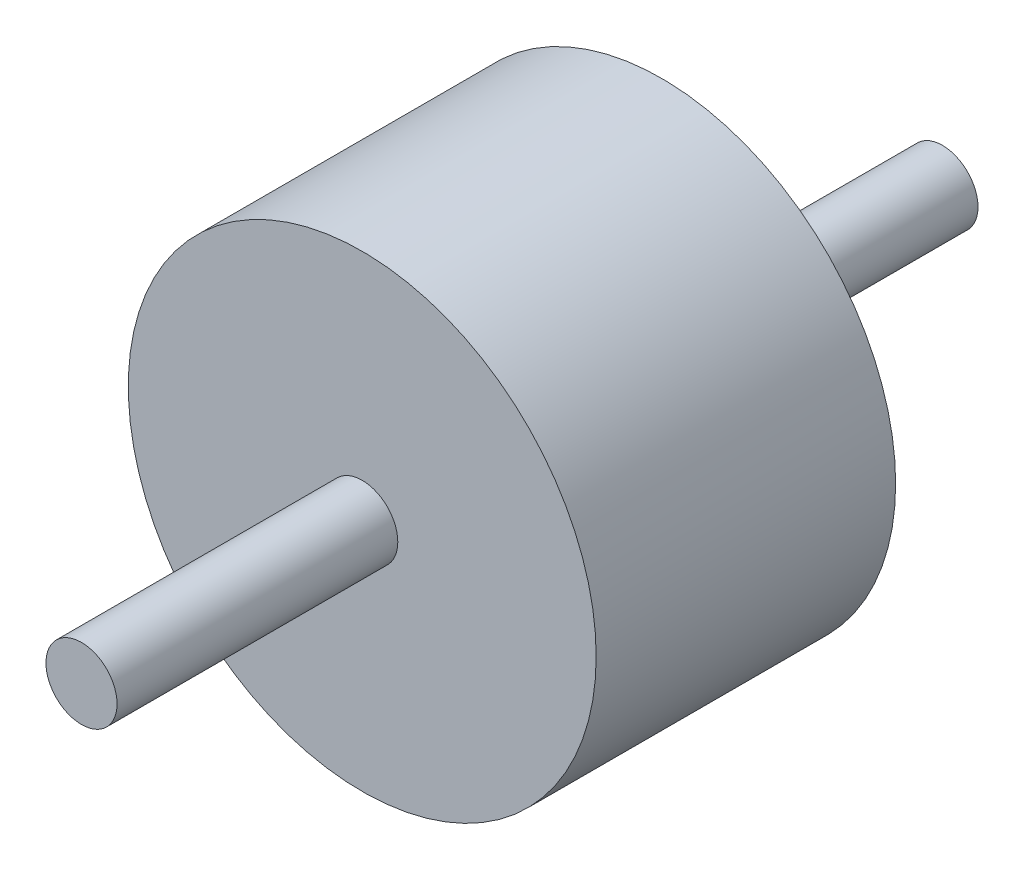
from build123d import *

# Parameters (mm, degrees)
SKETCH_1_R      = 1.25
EXTRUDE_1_DEPTH = 1.6
SKETCH_2_R      = 0.19
EXTRUDE_2_DEPTH = 1.5
EXTRUDE_START   = 1.5
SKETCH_3_R      = 0.19
EXTRUDE_3_DEPTH = 1.5


with BuildPart() as part:
    # Sketch 1 → Extrude 1 (new body)
    with BuildSketch(Plane.XY):
        Circle(SKETCH_1_R)
    extrude(amount=EXTRUDE_1_DEPTH)

    # Sketch 2 → Extrude 2 (add)
    with BuildSketch(Plane.XY.offset(1.6)):
        Circle(SKETCH_2_R)
    extrude(amount=EXTRUDE_2_DEPTH)

    # Sketch 3 → Extrude 3 (add)
    with BuildSketch(Plane(origin=(0, 0, 0), x_dir=(-1, 0, 0), z_dir=(0, 0, -1)).offset(EXTRUDE_START)):
        with Locations(Location((0, 0, 0), (0, 0, 180))):
            Circle(SKETCH_3_R)
    extrude(amount=-EXTRUDE_3_DEPTH)


solid = part.part
